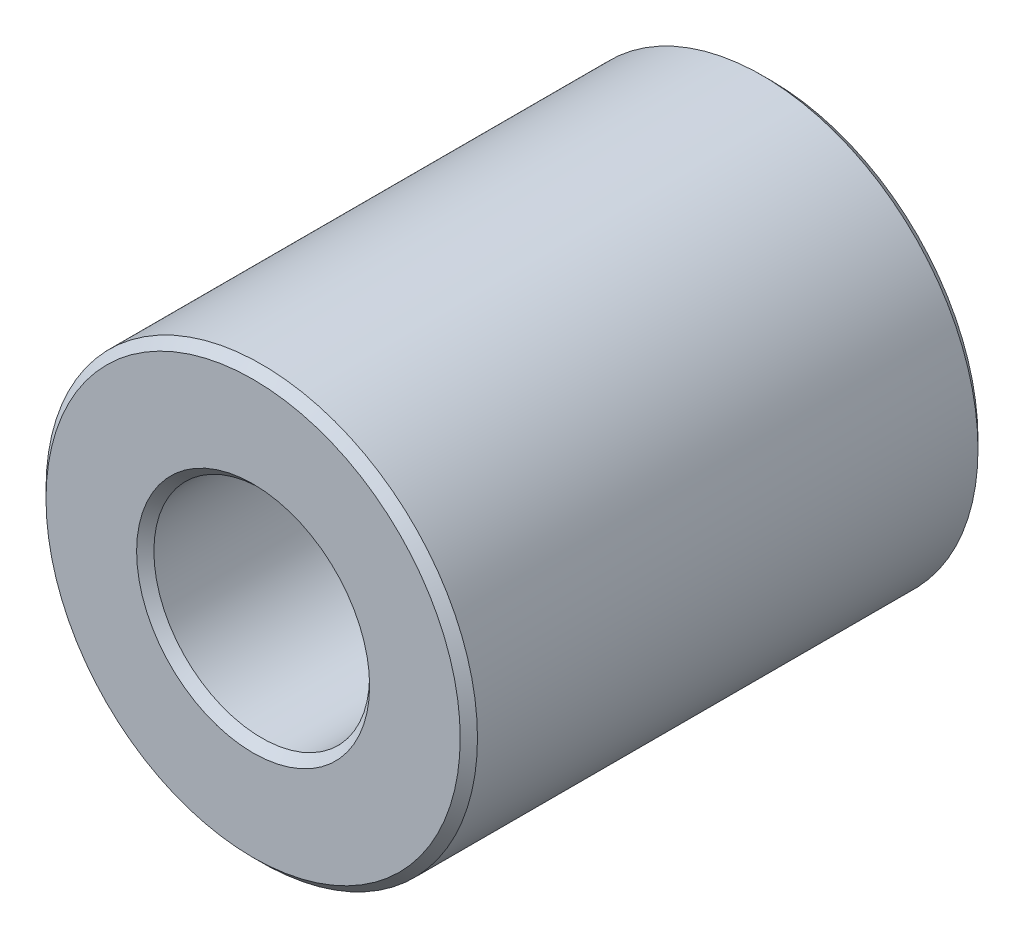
ISO-10303-21;
HEADER;
FILE_DESCRIPTION(('STEP AP214'),'2;1');
FILE_NAME('part.step','',(''),(''),'','','');
FILE_SCHEMA(('AUTOMOTIVE_DESIGN { 1 0 10303 214 1 1 1 1 }'));
ENDSEC;
DATA;
#1=APPLICATION_CONTEXT('core data for automotive mechanical design processes');
#2=APPLICATION_PROTOCOL_DEFINITION('international standard','automotive_design',2000,#1);
#3=PRODUCT_CONTEXT('',#1,'mechanical');
#4=PRODUCT('Part','Part','',(#3));
#5=PRODUCT_RELATED_PRODUCT_CATEGORY('part','',(#4));
#6=PRODUCT_DEFINITION_FORMATION('','',#4);
#7=PRODUCT_DEFINITION_CONTEXT('part definition',#1,'design');
#8=PRODUCT_DEFINITION('design','',#6,#7);
#9=PRODUCT_DEFINITION_SHAPE('','',#8);
#10=(LENGTH_UNIT() NAMED_UNIT(*) SI_UNIT(.MILLI.,.METRE.));
#11=(NAMED_UNIT(*) PLANE_ANGLE_UNIT() SI_UNIT($,.RADIAN.));
#12=(NAMED_UNIT(*) SI_UNIT($,.STERADIAN.) SOLID_ANGLE_UNIT());
#13=UNCERTAINTY_MEASURE_WITH_UNIT(LENGTH_MEASURE(1.E-05),#10,'distance_accuracy_value','');
#14=(GEOMETRIC_REPRESENTATION_CONTEXT(3) GLOBAL_UNCERTAINTY_ASSIGNED_CONTEXT((#13)) GLOBAL_UNIT_ASSIGNED_CONTEXT((#10,
#11,#12)) REPRESENTATION_CONTEXT('',''));
#15=CARTESIAN_POINT('',(0.,0.,0.));
#16=DIRECTION('',(0.,0.,1.));
#17=DIRECTION('',(1.,0.,0.));
#18=AXIS2_PLACEMENT_3D('',#15,#16,#17);
#19=CARTESIAN_POINT('',(0.,0.,3.));
#20=DIRECTION('',(0.,0.,1.));
#21=DIRECTION('',(1.,0.,0.));
#22=AXIS2_PLACEMENT_3D('',#19,#20,#21);
#23=PLANE('',#22);
#24=CARTESIAN_POINT('',(0.,0.,3.));
#25=DIRECTION('',(0.,0.,1.));
#26=DIRECTION('',(1.,0.,0.));
#27=AXIS2_PLACEMENT_3D('',#24,#25,#26);
#28=CIRCLE('',#27,1.35);
#29=CARTESIAN_POINT('',(1.35,0.,3.));
#30=VERTEX_POINT('',#29);
#31=EDGE_CURVE('E10',#30,#30,#28,.F.);
#32=ORIENTED_EDGE('',*,*,#31,.T.);
#33=EDGE_LOOP('',(#32));
#34=FACE_BOUND('',#33,.T.);
#35=CARTESIAN_POINT('',(0.,0.,3.));
#36=DIRECTION('',(0.,0.,1.));
#37=DIRECTION('',(1.,0.,0.));
#38=AXIS2_PLACEMENT_3D('',#35,#36,#37);
#39=CIRCLE('',#38,2.4);
#40=CARTESIAN_POINT('',(2.4,0.,3.));
#41=VERTEX_POINT('',#40);
#42=EDGE_CURVE('E45',#41,#41,#39,.T.);
#43=ORIENTED_EDGE('',*,*,#42,.T.);
#44=EDGE_LOOP('',(#43));
#45=FACE_BOUND('',#44,.T.);
#46=ADVANCED_FACE('F37',(#34,#45),#23,.T.);
#47=CARTESIAN_POINT('',(0.,0.,-3.));
#48=DIRECTION('',(0.,0.,1.));
#49=DIRECTION('',(1.,0.,0.));
#50=AXIS2_PLACEMENT_3D('',#47,#48,#49);
#51=PLANE('',#50);
#52=CARTESIAN_POINT('',(0.,0.,-3.));
#53=DIRECTION('',(0.,0.,1.));
#54=DIRECTION('',(1.,0.,0.));
#55=AXIS2_PLACEMENT_3D('',#52,#53,#54);
#56=CIRCLE('',#55,2.4);
#57=CARTESIAN_POINT('',(2.4,0.,-3.));
#58=VERTEX_POINT('',#57);
#59=EDGE_CURVE('E63',#58,#58,#56,.F.);
#60=ORIENTED_EDGE('',*,*,#59,.T.);
#61=EDGE_LOOP('',(#60));
#62=FACE_BOUND('',#61,.T.);
#63=CARTESIAN_POINT('',(0.,0.,-3.));
#64=DIRECTION('',(0.,0.,1.));
#65=DIRECTION('',(1.,0.,0.));
#66=AXIS2_PLACEMENT_3D('',#63,#64,#65);
#67=CIRCLE('',#66,1.35);
#68=CARTESIAN_POINT('',(1.35,0.,-3.));
#69=VERTEX_POINT('',#68);
#70=EDGE_CURVE('E67',#69,#69,#67,.T.);
#71=ORIENTED_EDGE('',*,*,#70,.T.);
#72=EDGE_LOOP('',(#71));
#73=FACE_BOUND('',#72,.T.);
#74=ADVANCED_FACE('F89',(#62,#73),#51,.F.);
#75=CARTESIAN_POINT('',(0.,0.,3.));
#76=DIRECTION('',(0.,0.,-1.));
#77=DIRECTION('',(-1.,0.,0.));
#78=AXIS2_PLACEMENT_3D('',#75,#76,#77);
#79=CYLINDRICAL_SURFACE('',#78,2.5);
#80=CARTESIAN_POINT('',(0.,0.,-2.9));
#81=DIRECTION('',(0.,0.,1.));
#82=DIRECTION('',(1.,0.,0.));
#83=AXIS2_PLACEMENT_3D('',#80,#81,#82);
#84=CIRCLE('',#83,2.5);
#85=CARTESIAN_POINT('',(2.5,0.,-2.9));
#86=VERTEX_POINT('',#85);
#87=EDGE_CURVE('E70',#86,#86,#84,.T.);
#88=ORIENTED_EDGE('',*,*,#87,.T.);
#89=EDGE_LOOP('',(#88));
#90=FACE_BOUND('',#89,.T.);
#91=CARTESIAN_POINT('',(0.,0.,2.9));
#92=DIRECTION('',(0.,0.,1.));
#93=DIRECTION('',(1.,0.,0.));
#94=AXIS2_PLACEMENT_3D('',#91,#92,#93);
#95=CIRCLE('',#94,2.5);
#96=CARTESIAN_POINT('',(2.5,0.,2.9));
#97=VERTEX_POINT('',#96);
#98=EDGE_CURVE('E73',#97,#97,#95,.F.);
#99=ORIENTED_EDGE('',*,*,#98,.T.);
#100=EDGE_LOOP('',(#99));
#101=FACE_BOUND('',#100,.T.);
#102=ADVANCED_FACE('F78',(#90,#101),#79,.T.);
#103=CARTESIAN_POINT('',(0.,0.,3.));
#104=DIRECTION('',(0.,0.,-1.));
#105=DIRECTION('',(-1.,0.,0.));
#106=AXIS2_PLACEMENT_3D('',#103,#104,#105);
#107=CYLINDRICAL_SURFACE('',#106,1.25);
#108=CARTESIAN_POINT('',(0.,0.,-2.9));
#109=DIRECTION('',(0.,0.,1.));
#110=DIRECTION('',(1.,0.,0.));
#111=AXIS2_PLACEMENT_3D('',#108,#109,#110);
#112=CIRCLE('',#111,1.25);
#113=CARTESIAN_POINT('',(1.25,0.,-2.9));
#114=VERTEX_POINT('',#113);
#115=EDGE_CURVE('E52',#114,#114,#112,.F.);
#116=ORIENTED_EDGE('',*,*,#115,.T.);
#117=EDGE_LOOP('',(#116));
#118=FACE_BOUND('',#117,.T.);
#119=CARTESIAN_POINT('',(0.,0.,2.9));
#120=DIRECTION('',(0.,0.,1.));
#121=DIRECTION('',(1.,0.,0.));
#122=AXIS2_PLACEMENT_3D('',#119,#120,#121);
#123=CIRCLE('',#122,1.25);
#124=CARTESIAN_POINT('',(1.25,0.,2.9));
#125=VERTEX_POINT('',#124);
#126=EDGE_CURVE('E57',#125,#125,#123,.T.);
#127=ORIENTED_EDGE('',*,*,#126,.T.);
#128=EDGE_LOOP('',(#127));
#129=FACE_BOUND('',#128,.T.);
#130=ADVANCED_FACE('F97',(#118,#129),#107,.F.);
#131=CARTESIAN_POINT('',(0.,0.,-2.9));
#132=DIRECTION('',(0.,0.,1.));
#133=DIRECTION('',(1.,0.,0.));
#134=AXIS2_PLACEMENT_3D('',#131,#132,#133);
#135=CONICAL_SURFACE('',#134,2.5,0.785398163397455);
#136=ORIENTED_EDGE('',*,*,#59,.F.);
#137=EDGE_LOOP('',(#136));
#138=FACE_BOUND('',#137,.T.);
#139=ORIENTED_EDGE('',*,*,#87,.F.);
#140=EDGE_LOOP('',(#139));
#141=FACE_BOUND('',#140,.T.);
#142=ADVANCED_FACE('F102',(#138,#141),#135,.T.);
#143=CARTESIAN_POINT('',(0.,0.,-3.));
#144=DIRECTION('',(0.,0.,-1.));
#145=DIRECTION('',(-1.,0.,0.));
#146=AXIS2_PLACEMENT_3D('',#143,#144,#145);
#147=CONICAL_SURFACE('',#146,1.35,0.785398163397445);
#148=ORIENTED_EDGE('',*,*,#115,.F.);
#149=EDGE_LOOP('',(#148));
#150=FACE_BOUND('',#149,.T.);
#151=ORIENTED_EDGE('',*,*,#70,.F.);
#152=EDGE_LOOP('',(#151));
#153=FACE_BOUND('',#152,.T.);
#154=ADVANCED_FACE('F86',(#150,#153),#147,.F.);
#155=CARTESIAN_POINT('',(0.,0.,2.9));
#156=DIRECTION('',(0.,0.,1.));
#157=DIRECTION('',(1.,0.,0.));
#158=AXIS2_PLACEMENT_3D('',#155,#156,#157);
#159=CONICAL_SURFACE('',#158,1.25,0.785398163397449);
#160=ORIENTED_EDGE('',*,*,#31,.F.);
#161=EDGE_LOOP('',(#160));
#162=FACE_BOUND('',#161,.T.);
#163=ORIENTED_EDGE('',*,*,#126,.F.);
#164=EDGE_LOOP('',(#163));
#165=FACE_BOUND('',#164,.T.);
#166=ADVANCED_FACE('F82',(#162,#165),#159,.F.);
#167=CARTESIAN_POINT('',(0.,0.,3.));
#168=DIRECTION('',(0.,0.,-1.));
#169=DIRECTION('',(-1.,0.,0.));
#170=AXIS2_PLACEMENT_3D('',#167,#168,#169);
#171=CONICAL_SURFACE('',#170,2.4,0.785398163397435);
#172=ORIENTED_EDGE('',*,*,#98,.F.);
#173=EDGE_LOOP('',(#172));
#174=FACE_BOUND('',#173,.T.);
#175=ORIENTED_EDGE('',*,*,#42,.F.);
#176=EDGE_LOOP('',(#175));
#177=FACE_BOUND('',#176,.T.);
#178=ADVANCED_FACE('F39',(#174,#177),#171,.T.);
#179=CLOSED_SHELL('',(#46,#74,#102,#130,#142,#154,#166,#178));
#180=MANIFOLD_SOLID_BREP('B2',#179);
#181=ADVANCED_BREP_SHAPE_REPRESENTATION('',(#18,#180),#14);
#182=SHAPE_DEFINITION_REPRESENTATION(#9,#181);
ENDSEC;
END-ISO-10303-21;
